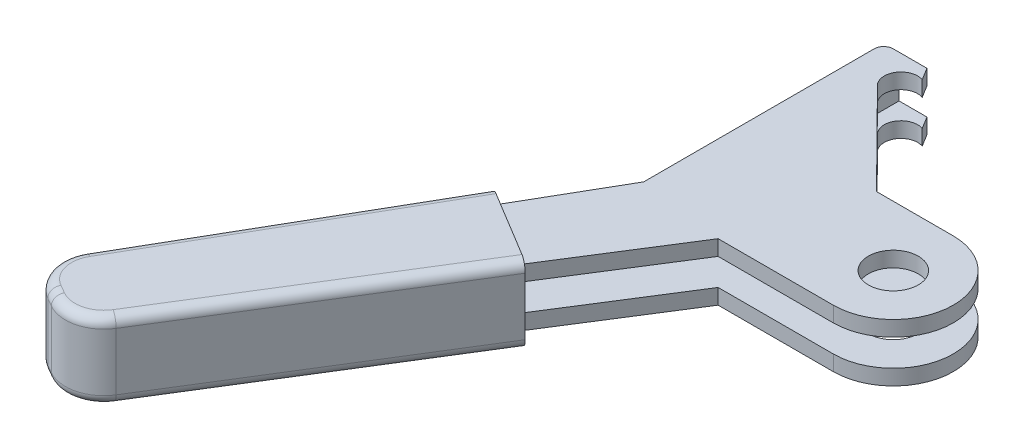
ISO-10303-21;
HEADER;
FILE_DESCRIPTION(('STEP AP214'),'2;1');
FILE_NAME('part.step','',(''),(''),'','','');
FILE_SCHEMA(('AUTOMOTIVE_DESIGN { 1 0 10303 214 1 1 1 1 }'));
ENDSEC;
DATA;
#1=APPLICATION_CONTEXT('core data for automotive mechanical design processes');
#2=APPLICATION_PROTOCOL_DEFINITION('international standard','automotive_design',2000,#1);
#3=PRODUCT_CONTEXT('',#1,'mechanical');
#4=PRODUCT('Part','Part','',(#3));
#5=PRODUCT_RELATED_PRODUCT_CATEGORY('part','',(#4));
#6=PRODUCT_DEFINITION_FORMATION('','',#4);
#7=PRODUCT_DEFINITION_CONTEXT('part definition',#1,'design');
#8=PRODUCT_DEFINITION('design','',#6,#7);
#9=PRODUCT_DEFINITION_SHAPE('','',#8);
#10=(LENGTH_UNIT() NAMED_UNIT(*) SI_UNIT(.MILLI.,.METRE.));
#11=(NAMED_UNIT(*) PLANE_ANGLE_UNIT() SI_UNIT($,.RADIAN.));
#12=(NAMED_UNIT(*) SI_UNIT($,.STERADIAN.) SOLID_ANGLE_UNIT());
#13=UNCERTAINTY_MEASURE_WITH_UNIT(LENGTH_MEASURE(1.E-05),#10,'distance_accuracy_value','');
#14=(GEOMETRIC_REPRESENTATION_CONTEXT(3) GLOBAL_UNCERTAINTY_ASSIGNED_CONTEXT((#13)) GLOBAL_UNIT_ASSIGNED_CONTEXT((#10,
#11,#12)) REPRESENTATION_CONTEXT('',''));
#15=CARTESIAN_POINT('',(0.,0.,0.));
#16=DIRECTION('',(0.,0.,1.));
#17=DIRECTION('',(1.,0.,0.));
#18=AXIS2_PLACEMENT_3D('',#15,#16,#17);
#19=CARTESIAN_POINT('',(-12.,3.,6.25));
#20=DIRECTION('',(-0.845429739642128,0.,-0.534086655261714));
#21=DIRECTION('',(0.,-1.,0.));
#22=AXIS2_PLACEMENT_3D('',#19,#20,#21);
#23=PLANE('',#22);
#24=DIRECTION('',(0.534086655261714,0.,-0.845429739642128));
#25=VECTOR('',#24,1.);
#26=CARTESIAN_POINT('',(-12.,3.,6.25));
#27=LINE('',#26,#25);
#28=CARTESIAN_POINT('',(-19.9323201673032,3.,18.8064256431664));
#29=VERTEX_POINT('',#28);
#30=CARTESIAN_POINT('',(-12.,3.,6.25));
#31=VERTEX_POINT('',#30);
#32=EDGE_CURVE('E370',#29,#31,#27,.T.);
#33=ORIENTED_EDGE('',*,*,#32,.F.);
#34=DIRECTION('',(0.,-1.,0.));
#35=VECTOR('',#34,1.);
#36=CARTESIAN_POINT('',(-19.9323201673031,3.,18.8064256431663));
#37=LINE('',#36,#35);
#38=CARTESIAN_POINT('',(-19.9323201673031,1.40000000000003,18.8064256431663));
#39=VERTEX_POINT('',#38);
#40=EDGE_CURVE('E318',#29,#39,#37,.T.);
#41=ORIENTED_EDGE('',*,*,#40,.T.);
#42=DIRECTION('',(0.534086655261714,0.,-0.845429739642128));
#43=VECTOR('',#42,1.);
#44=CARTESIAN_POINT('',(-12.,1.40000000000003,6.25));
#45=LINE('',#44,#43);
#46=CARTESIAN_POINT('',(-12.,1.40000000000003,6.25));
#47=VERTEX_POINT('',#46);
#48=EDGE_CURVE('E438',#39,#47,#45,.T.);
#49=ORIENTED_EDGE('',*,*,#48,.T.);
#50=DIRECTION('',(0.,-1.,0.));
#51=VECTOR('',#50,1.);
#52=CARTESIAN_POINT('',(-12.,3.,6.25));
#53=LINE('',#52,#51);
#54=EDGE_CURVE('E331',#31,#47,#53,.T.);
#55=ORIENTED_EDGE('',*,*,#54,.F.);
#56=EDGE_LOOP('',(#33,#41,#49,#55));
#57=FACE_BOUND('',#56,.T.);
#58=ADVANCED_FACE('F14',(#57),#23,.F.);
#59=CARTESIAN_POINT('',(-19.4,1.4,84.));
#60=DIRECTION('',(-1.,0.,0.));
#61=DIRECTION('',(0.,1.,0.));
#62=AXIS2_PLACEMENT_3D('',#59,#60,#61);
#63=PLANE('',#62);
#64=DIRECTION('',(0.,0.,-1.));
#65=VECTOR('',#64,1.);
#66=CARTESIAN_POINT('',(-19.4,1.4,84.));
#67=LINE('',#66,#65);
#68=CARTESIAN_POINT('',(-19.4,1.4,5.4287187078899));
#69=VERTEX_POINT('',#68);
#70=CARTESIAN_POINT('',(-19.4,1.4,-20.));
#71=VERTEX_POINT('',#70);
#72=EDGE_CURVE('E474',#69,#71,#67,.T.);
#73=ORIENTED_EDGE('',*,*,#72,.F.);
#74=DIRECTION('',(0.,-1.,0.));
#75=VECTOR('',#74,1.);
#76=CARTESIAN_POINT('',(-19.4,1.4,5.4287187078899));
#77=LINE('',#76,#75);
#78=CARTESIAN_POINT('',(-19.4,-1.4,5.4287187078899));
#79=VERTEX_POINT('',#78);
#80=EDGE_CURVE('E470',#69,#79,#77,.T.);
#81=ORIENTED_EDGE('',*,*,#80,.T.);
#82=DIRECTION('',(0.,0.,-1.));
#83=VECTOR('',#82,1.);
#84=CARTESIAN_POINT('',(-19.4,-1.4,84.));
#85=LINE('',#84,#83);
#86=CARTESIAN_POINT('',(-19.4,-1.4,-20.));
#87=VERTEX_POINT('',#86);
#88=EDGE_CURVE('E425',#79,#87,#85,.T.);
#89=ORIENTED_EDGE('',*,*,#88,.T.);
#90=DIRECTION('',(0.,1.,0.));
#91=VECTOR('',#90,1.);
#92=CARTESIAN_POINT('',(-19.4,1.4,-20.));
#93=LINE('',#92,#91);
#94=EDGE_CURVE('E417',#87,#71,#93,.T.);
#95=ORIENTED_EDGE('',*,*,#94,.T.);
#96=EDGE_LOOP('',(#73,#81,#89,#95));
#97=FACE_BOUND('',#96,.T.);
#98=ADVANCED_FACE('F933',(#97),#63,.F.);
#99=CARTESIAN_POINT('',(-16.5,3.,-20.));
#100=DIRECTION('',(-0.850594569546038,0.,0.525822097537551));
#101=DIRECTION('',(0.,-1.,0.));
#102=AXIS2_PLACEMENT_3D('',#99,#100,#101);
#103=PLANE('',#102);
#104=DIRECTION('',(0.,-1.,0.));
#105=VECTOR('',#104,1.);
#106=CARTESIAN_POINT('',(-15.7112668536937,3.,-18.724108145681));
#107=LINE('',#106,#105);
#108=CARTESIAN_POINT('',(-15.7112668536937,3.,-18.724108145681));
#109=VERTEX_POINT('',#108);
#110=CARTESIAN_POINT('',(-15.7112668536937,1.4,-18.724108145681));
#111=VERTEX_POINT('',#110);
#112=EDGE_CURVE('E348',#109,#111,#107,.T.);
#113=ORIENTED_EDGE('',*,*,#112,.T.);
#114=DIRECTION('',(-0.525822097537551,0.,-0.850594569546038));
#115=VECTOR('',#114,1.);
#116=CARTESIAN_POINT('',(-16.5,1.4,-20.));
#117=LINE('',#116,#115);
#118=CARTESIAN_POINT('',(-16.5,1.4,-20.));
#119=VERTEX_POINT('',#118);
#120=EDGE_CURVE('E359',#111,#119,#117,.T.);
#121=ORIENTED_EDGE('',*,*,#120,.T.);
#122=DIRECTION('',(0.,-1.,0.));
#123=VECTOR('',#122,1.);
#124=CARTESIAN_POINT('',(-16.5,3.,-20.));
#125=LINE('',#124,#123);
#126=CARTESIAN_POINT('',(-16.5,3.,-20.));
#127=VERTEX_POINT('',#126);
#128=EDGE_CURVE('E409',#127,#119,#125,.T.);
#129=ORIENTED_EDGE('',*,*,#128,.F.);
#130=DIRECTION('',(-0.525822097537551,0.,-0.850594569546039));
#131=VECTOR('',#130,1.);
#132=CARTESIAN_POINT('',(-16.5,3.,-20.));
#133=LINE('',#132,#131);
#134=EDGE_CURVE('E392',#109,#127,#133,.T.);
#135=ORIENTED_EDGE('',*,*,#134,.F.);
#136=EDGE_LOOP('',(#113,#121,#129,#135));
#137=FACE_BOUND('',#136,.T.);
#138=ADVANCED_FACE('F927',(#137),#103,.F.);
#139=CARTESIAN_POINT('',(-16.2889917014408,3.,-17.0868016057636));
#140=DIRECTION('',(0.,-1.,0.));
#141=DIRECTION('',(1.,0.,0.));
#142=AXIS2_PLACEMENT_3D('',#139,#140,#141);
#143=CYLINDRICAL_SURFACE('',#142,1.73624269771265);
#144=DIRECTION('',(0.,-1.,0.));
#145=VECTOR('',#144,1.);
#146=CARTESIAN_POINT('',(-17.430589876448,3.,-15.7786378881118));
#147=LINE('',#146,#145);
#148=CARTESIAN_POINT('',(-17.430589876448,3.,-15.7786378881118));
#149=VERTEX_POINT('',#148);
#150=CARTESIAN_POINT('',(-17.430589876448,1.4,-15.7786378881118));
#151=VERTEX_POINT('',#150);
#152=EDGE_CURVE('E456',#149,#151,#147,.T.);
#153=ORIENTED_EDGE('',*,*,#152,.T.);
#154=CARTESIAN_POINT('',(-16.2889917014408,1.4,-17.0868016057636));
#155=DIRECTION('',(0.,-1.,0.));
#156=DIRECTION('',(-1.,0.,0.));
#157=AXIS2_PLACEMENT_3D('',#154,#155,#156);
#158=CIRCLE('',#157,1.73624269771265);
#159=EDGE_CURVE('E459',#151,#111,#158,.T.);
#160=ORIENTED_EDGE('',*,*,#159,.T.);
#161=ORIENTED_EDGE('',*,*,#112,.F.);
#162=CARTESIAN_POINT('',(-16.2889917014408,3.,-17.0868016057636));
#163=DIRECTION('',(0.,-1.,0.));
#164=DIRECTION('',(-1.,0.,0.));
#165=AXIS2_PLACEMENT_3D('',#162,#163,#164);
#166=CIRCLE('',#165,1.73624269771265);
#167=EDGE_CURVE('E387',#149,#109,#166,.T.);
#168=ORIENTED_EDGE('',*,*,#167,.F.);
#169=EDGE_LOOP('',(#153,#160,#161,#168));
#170=FACE_BOUND('',#169,.T.);
#171=ADVANCED_FACE('F932',(#170),#143,.F.);
#172=CARTESIAN_POINT('',(-17.430589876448,3.,-15.7786378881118));
#173=DIRECTION('',(-0.710754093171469,0.,0.70344055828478));
#174=DIRECTION('',(0.,-1.,0.));
#175=AXIS2_PLACEMENT_3D('',#172,#173,#174);
#176=PLANE('',#175);
#177=DIRECTION('',(0.,-1.,0.));
#178=VECTOR('',#177,1.);
#179=CARTESIAN_POINT('',(-8.,3.,-6.25));
#180=LINE('',#179,#178);
#181=CARTESIAN_POINT('',(-8.,3.,-6.25));
#182=VERTEX_POINT('',#181);
#183=CARTESIAN_POINT('',(-8.,1.4,-6.25));
#184=VERTEX_POINT('',#183);
#185=EDGE_CURVE('E455',#182,#184,#180,.T.);
#186=ORIENTED_EDGE('',*,*,#185,.T.);
#187=DIRECTION('',(-0.70344055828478,0.,-0.710754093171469));
#188=VECTOR('',#187,1.);
#189=CARTESIAN_POINT('',(-17.430589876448,1.4,-15.7786378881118));
#190=LINE('',#189,#188);
#191=EDGE_CURVE('E451',#184,#151,#190,.T.);
#192=ORIENTED_EDGE('',*,*,#191,.T.);
#193=ORIENTED_EDGE('',*,*,#152,.F.);
#194=DIRECTION('',(-0.70344055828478,0.,-0.710754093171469));
#195=VECTOR('',#194,1.);
#196=CARTESIAN_POINT('',(-17.430589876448,3.,-15.7786378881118));
#197=LINE('',#196,#195);
#198=EDGE_CURVE('E391',#182,#149,#197,.T.);
#199=ORIENTED_EDGE('',*,*,#198,.F.);
#200=EDGE_LOOP('',(#186,#192,#193,#199));
#201=FACE_BOUND('',#200,.T.);
#202=ADVANCED_FACE('F943',(#201),#176,.F.);
#203=CARTESIAN_POINT('',(-8.,3.,-6.25));
#204=DIRECTION('',(0.,0.,1.));
#205=DIRECTION('',(-1.,0.,0.));
#206=AXIS2_PLACEMENT_3D('',#203,#204,#205);
#207=PLANE('',#206);
#208=DIRECTION('',(0.,-1.,0.));
#209=VECTOR('',#208,1.);
#210=CARTESIAN_POINT('',(0.,3.,-6.25));
#211=LINE('',#210,#209);
#212=CARTESIAN_POINT('',(0.,3.,-6.25));
#213=VERTEX_POINT('',#212);
#214=CARTESIAN_POINT('',(0.,1.39999999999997,-6.25));
#215=VERTEX_POINT('',#214);
#216=EDGE_CURVE('E447',#213,#215,#211,.T.);
#217=ORIENTED_EDGE('',*,*,#216,.T.);
#218=DIRECTION('',(-1.,0.,0.));
#219=VECTOR('',#218,1.);
#220=CARTESIAN_POINT('',(-8.,1.4,-6.25));
#221=LINE('',#220,#219);
#222=EDGE_CURVE('E450',#215,#184,#221,.T.);
#223=ORIENTED_EDGE('',*,*,#222,.T.);
#224=ORIENTED_EDGE('',*,*,#185,.F.);
#225=DIRECTION('',(-1.,0.,0.));
#226=VECTOR('',#225,1.);
#227=CARTESIAN_POINT('',(-8.,3.,-6.25));
#228=LINE('',#227,#226);
#229=EDGE_CURVE('E463',#213,#182,#228,.T.);
#230=ORIENTED_EDGE('',*,*,#229,.F.);
#231=EDGE_LOOP('',(#217,#223,#224,#230));
#232=FACE_BOUND('',#231,.T.);
#233=ADVANCED_FACE('F954',(#232),#207,.F.);
#234=CARTESIAN_POINT('',(0.,3.,0.));
#235=DIRECTION('',(0.,-1.,0.));
#236=DIRECTION('',(1.,0.,0.));
#237=AXIS2_PLACEMENT_3D('',#234,#235,#236);
#238=CYLINDRICAL_SURFACE('',#237,6.25);
#239=CARTESIAN_POINT('',(0.,3.,0.));
#240=DIRECTION('',(0.,1.,0.));
#241=DIRECTION('',(-1.,0.,0.));
#242=AXIS2_PLACEMENT_3D('',#239,#240,#241);
#243=CIRCLE('',#242,6.25);
#244=CARTESIAN_POINT('',(0.,3.,6.25));
#245=VERTEX_POINT('',#244);
#246=EDGE_CURVE('E371',#245,#213,#243,.T.);
#247=ORIENTED_EDGE('',*,*,#246,.F.);
#248=DIRECTION('',(0.,-1.,0.));
#249=VECTOR('',#248,1.);
#250=CARTESIAN_POINT('',(0.,3.,6.25));
#251=LINE('',#250,#249);
#252=CARTESIAN_POINT('',(0.,1.39999999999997,6.25));
#253=VERTEX_POINT('',#252);
#254=EDGE_CURVE('E443',#245,#253,#251,.T.);
#255=ORIENTED_EDGE('',*,*,#254,.T.);
#256=CARTESIAN_POINT('',(0.,1.39999999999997,0.));
#257=DIRECTION('',(0.,1.,0.));
#258=DIRECTION('',(-1.,0.,0.));
#259=AXIS2_PLACEMENT_3D('',#256,#257,#258);
#260=CIRCLE('',#259,6.25);
#261=EDGE_CURVE('E386',#253,#215,#260,.T.);
#262=ORIENTED_EDGE('',*,*,#261,.T.);
#263=ORIENTED_EDGE('',*,*,#216,.F.);
#264=EDGE_LOOP('',(#247,#255,#262,#263));
#265=FACE_BOUND('',#264,.T.);
#266=ADVANCED_FACE('F949',(#265),#238,.T.);
#267=CARTESIAN_POINT('',(0.,3.,6.25));
#268=DIRECTION('',(0.,0.,-1.));
#269=DIRECTION('',(0.,-1.,0.));
#270=AXIS2_PLACEMENT_3D('',#267,#268,#269);
#271=PLANE('',#270);
#272=ORIENTED_EDGE('',*,*,#54,.T.);
#273=DIRECTION('',(1.,0.,0.));
#274=VECTOR('',#273,1.);
#275=CARTESIAN_POINT('',(0.,1.39999999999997,6.25));
#276=LINE('',#275,#274);
#277=EDGE_CURVE('E338',#47,#253,#276,.T.);
#278=ORIENTED_EDGE('',*,*,#277,.T.);
#279=ORIENTED_EDGE('',*,*,#254,.F.);
#280=DIRECTION('',(1.,0.,0.));
#281=VECTOR('',#280,1.);
#282=CARTESIAN_POINT('',(0.,3.,6.25));
#283=LINE('',#282,#281);
#284=EDGE_CURVE('E366',#31,#245,#283,.T.);
#285=ORIENTED_EDGE('',*,*,#284,.F.);
#286=EDGE_LOOP('',(#272,#278,#279,#285));
#287=FACE_BOUND('',#286,.T.);
#288=ADVANCED_FACE('F788',(#287),#271,.F.);
#289=CARTESIAN_POINT('',(0.,3.,0.));
#290=DIRECTION('',(0.,-1.,0.));
#291=DIRECTION('',(1.,0.,0.));
#292=AXIS2_PLACEMENT_3D('',#289,#290,#291);
#293=CYLINDRICAL_SURFACE('',#292,2.6);
#294=CARTESIAN_POINT('',(0.,1.39999999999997,0.));
#295=DIRECTION('',(0.,1.,0.));
#296=DIRECTION('',(-1.,0.,0.));
#297=AXIS2_PLACEMENT_3D('',#294,#295,#296);
#298=CIRCLE('',#297,2.6);
#299=CARTESIAN_POINT('',(-2.59999999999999,1.39999999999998,0.));
#300=VERTEX_POINT('',#299);
#301=EDGE_CURVE('E350',#300,#300,#298,.T.);
#302=ORIENTED_EDGE('',*,*,#301,.F.);
#303=EDGE_LOOP('',(#302));
#304=FACE_BOUND('',#303,.T.);
#305=CARTESIAN_POINT('',(0.,3.,0.));
#306=DIRECTION('',(0.,1.,0.));
#307=DIRECTION('',(-1.,0.,0.));
#308=AXIS2_PLACEMENT_3D('',#305,#306,#307);
#309=CIRCLE('',#308,2.6);
#310=CARTESIAN_POINT('',(-2.59999999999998,3.,0.));
#311=VERTEX_POINT('',#310);
#312=EDGE_CURVE('E382',#311,#311,#309,.T.);
#313=ORIENTED_EDGE('',*,*,#312,.T.);
#314=EDGE_LOOP('',(#313));
#315=FACE_BOUND('',#314,.T.);
#316=ADVANCED_FACE('F900',(#304,#315),#293,.F.);
#317=CARTESIAN_POINT('',(0.,3.,0.));
#318=DIRECTION('',(0.,-1.,0.));
#319=DIRECTION('',(1.,0.,0.));
#320=AXIS2_PLACEMENT_3D('',#317,#318,#319);
#321=CYLINDRICAL_SURFACE('',#320,6.25);
#322=CARTESIAN_POINT('',(0.,-1.40000000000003,0.));
#323=DIRECTION('',(0.,-1.,0.));
#324=DIRECTION('',(1.,0.,0.));
#325=AXIS2_PLACEMENT_3D('',#322,#323,#324);
#326=CIRCLE('',#325,6.25);
#327=CARTESIAN_POINT('',(0.,-1.40000000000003,-6.25));
#328=VERTEX_POINT('',#327);
#329=CARTESIAN_POINT('',(0.,-1.40000000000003,6.25));
#330=VERTEX_POINT('',#329);
#331=EDGE_CURVE('E396',#328,#330,#326,.T.);
#332=ORIENTED_EDGE('',*,*,#331,.T.);
#333=DIRECTION('',(0.,-1.,0.));
#334=VECTOR('',#333,1.);
#335=CARTESIAN_POINT('',(0.,3.,6.25));
#336=LINE('',#335,#334);
#337=CARTESIAN_POINT('',(0.,-3.,6.25));
#338=VERTEX_POINT('',#337);
#339=EDGE_CURVE('E429',#330,#338,#336,.T.);
#340=ORIENTED_EDGE('',*,*,#339,.T.);
#341=CARTESIAN_POINT('',(0.,-3.,0.));
#342=DIRECTION('',(0.,1.,0.));
#343=DIRECTION('',(-1.,0.,0.));
#344=AXIS2_PLACEMENT_3D('',#341,#342,#343);
#345=CIRCLE('',#344,6.25);
#346=CARTESIAN_POINT('',(0.,-3.,-6.25));
#347=VERTEX_POINT('',#346);
#348=EDGE_CURVE('E408',#338,#347,#345,.T.);
#349=ORIENTED_EDGE('',*,*,#348,.T.);
#350=DIRECTION('',(0.,-1.,0.));
#351=VECTOR('',#350,1.);
#352=CARTESIAN_POINT('',(0.,3.,-6.25));
#353=LINE('',#352,#351);
#354=EDGE_CURVE('E361',#328,#347,#353,.T.);
#355=ORIENTED_EDGE('',*,*,#354,.F.);
#356=EDGE_LOOP('',(#332,#340,#349,#355));
#357=FACE_BOUND('',#356,.T.);
#358=ADVANCED_FACE('F825',(#357),#321,.T.);
#359=CARTESIAN_POINT('',(-8.,3.,-6.25));
#360=DIRECTION('',(0.,0.,1.));
#361=DIRECTION('',(-1.,0.,0.));
#362=AXIS2_PLACEMENT_3D('',#359,#360,#361);
#363=PLANE('',#362);
#364=DIRECTION('',(0.,-1.,0.));
#365=VECTOR('',#364,1.);
#366=CARTESIAN_POINT('',(-8.,3.,-6.25));
#367=LINE('',#366,#365);
#368=CARTESIAN_POINT('',(-8.,-1.4,-6.25));
#369=VERTEX_POINT('',#368);
#370=CARTESIAN_POINT('',(-8.,-3.,-6.25));
#371=VERTEX_POINT('',#370);
#372=EDGE_CURVE('E380',#369,#371,#367,.T.);
#373=ORIENTED_EDGE('',*,*,#372,.F.);
#374=DIRECTION('',(1.,0.,0.));
#375=VECTOR('',#374,1.);
#376=CARTESIAN_POINT('',(-8.,-1.4,-6.25));
#377=LINE('',#376,#375);
#378=EDGE_CURVE('E364',#369,#328,#377,.T.);
#379=ORIENTED_EDGE('',*,*,#378,.T.);
#380=ORIENTED_EDGE('',*,*,#354,.T.);
#381=DIRECTION('',(-1.,0.,0.));
#382=VECTOR('',#381,1.);
#383=CARTESIAN_POINT('',(-8.,-3.,-6.25));
#384=LINE('',#383,#382);
#385=EDGE_CURVE('E365',#347,#371,#384,.T.);
#386=ORIENTED_EDGE('',*,*,#385,.T.);
#387=EDGE_LOOP('',(#373,#379,#380,#386));
#388=FACE_BOUND('',#387,.T.);
#389=ADVANCED_FACE('F822',(#388),#363,.F.);
#390=CARTESIAN_POINT('',(-17.430589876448,3.,-15.7786378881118));
#391=DIRECTION('',(-0.710754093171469,0.,0.70344055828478));
#392=DIRECTION('',(0.,-1.,0.));
#393=AXIS2_PLACEMENT_3D('',#390,#391,#392);
#394=PLANE('',#393);
#395=DIRECTION('',(0.,-1.,0.));
#396=VECTOR('',#395,1.);
#397=CARTESIAN_POINT('',(-17.430589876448,3.,-15.7786378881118));
#398=LINE('',#397,#396);
#399=CARTESIAN_POINT('',(-17.430589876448,-1.4,-15.7786378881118));
#400=VERTEX_POINT('',#399);
#401=CARTESIAN_POINT('',(-17.430589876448,-3.,-15.7786378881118));
#402=VERTEX_POINT('',#401);
#403=EDGE_CURVE('E439',#400,#402,#398,.T.);
#404=ORIENTED_EDGE('',*,*,#403,.F.);
#405=DIRECTION('',(0.70344055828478,0.,0.710754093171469));
#406=VECTOR('',#405,1.);
#407=CARTESIAN_POINT('',(-17.430589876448,-1.4,-15.7786378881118));
#408=LINE('',#407,#406);
#409=EDGE_CURVE('E375',#400,#369,#408,.T.);
#410=ORIENTED_EDGE('',*,*,#409,.T.);
#411=ORIENTED_EDGE('',*,*,#372,.T.);
#412=DIRECTION('',(-0.70344055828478,0.,-0.710754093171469));
#413=VECTOR('',#412,1.);
#414=CARTESIAN_POINT('',(-17.430589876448,-3.,-15.7786378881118));
#415=LINE('',#414,#413);
#416=EDGE_CURVE('E376',#371,#402,#415,.T.);
#417=ORIENTED_EDGE('',*,*,#416,.T.);
#418=EDGE_LOOP('',(#404,#410,#411,#417));
#419=FACE_BOUND('',#418,.T.);
#420=ADVANCED_FACE('F818',(#419),#394,.F.);
#421=CARTESIAN_POINT('',(-16.2889917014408,3.,-17.0868016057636));
#422=DIRECTION('',(0.,-1.,0.));
#423=DIRECTION('',(1.,0.,0.));
#424=AXIS2_PLACEMENT_3D('',#421,#422,#423);
#425=CYLINDRICAL_SURFACE('',#424,1.73624269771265);
#426=DIRECTION('',(0.,-1.,0.));
#427=VECTOR('',#426,1.);
#428=CARTESIAN_POINT('',(-15.7112668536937,3.,-18.724108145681));
#429=LINE('',#428,#427);
#430=CARTESIAN_POINT('',(-15.7112668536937,-1.4,-18.724108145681));
#431=VERTEX_POINT('',#430);
#432=CARTESIAN_POINT('',(-15.7112668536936,-3.,-18.724108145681));
#433=VERTEX_POINT('',#432);
#434=EDGE_CURVE('E516',#431,#433,#429,.T.);
#435=ORIENTED_EDGE('',*,*,#434,.F.);
#436=CARTESIAN_POINT('',(-16.2889917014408,-1.4,-17.0868016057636));
#437=DIRECTION('',(0.,1.,0.));
#438=DIRECTION('',(1.,0.,0.));
#439=AXIS2_PLACEMENT_3D('',#436,#437,#438);
#440=CIRCLE('',#439,1.73624269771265);
#441=EDGE_CURVE('E381',#431,#400,#440,.T.);
#442=ORIENTED_EDGE('',*,*,#441,.T.);
#443=ORIENTED_EDGE('',*,*,#403,.T.);
#444=CARTESIAN_POINT('',(-16.2889917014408,-3.,-17.0868016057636));
#445=DIRECTION('',(0.,-1.,0.));
#446=DIRECTION('',(-1.,0.,0.));
#447=AXIS2_PLACEMENT_3D('',#444,#445,#446);
#448=CIRCLE('',#447,1.73624269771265);
#449=EDGE_CURVE('E442',#402,#433,#448,.T.);
#450=ORIENTED_EDGE('',*,*,#449,.T.);
#451=EDGE_LOOP('',(#435,#442,#443,#450));
#452=FACE_BOUND('',#451,.T.);
#453=ADVANCED_FACE('F814',(#452),#425,.F.);
#454=CARTESIAN_POINT('',(-16.5,3.,-20.));
#455=DIRECTION('',(-0.850594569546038,0.,0.525822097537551));
#456=DIRECTION('',(0.,-1.,0.));
#457=AXIS2_PLACEMENT_3D('',#454,#455,#456);
#458=PLANE('',#457);
#459=DIRECTION('',(0.,-1.,0.));
#460=VECTOR('',#459,1.);
#461=CARTESIAN_POINT('',(-16.5,3.,-20.));
#462=LINE('',#461,#460);
#463=CARTESIAN_POINT('',(-16.5,-1.4,-20.));
#464=VERTEX_POINT('',#463);
#465=CARTESIAN_POINT('',(-16.5,-3.,-20.));
#466=VERTEX_POINT('',#465);
#467=EDGE_CURVE('E356',#464,#466,#462,.T.);
#468=ORIENTED_EDGE('',*,*,#467,.F.);
#469=DIRECTION('',(0.525822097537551,0.,0.850594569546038));
#470=VECTOR('',#469,1.);
#471=CARTESIAN_POINT('',(-16.5,-1.4,-20.));
#472=LINE('',#471,#470);
#473=EDGE_CURVE('E520',#464,#431,#472,.T.);
#474=ORIENTED_EDGE('',*,*,#473,.T.);
#475=ORIENTED_EDGE('',*,*,#434,.T.);
#476=DIRECTION('',(-0.525822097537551,0.,-0.850594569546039));
#477=VECTOR('',#476,1.);
#478=CARTESIAN_POINT('',(-16.5,-3.,-20.));
#479=LINE('',#478,#477);
#480=EDGE_CURVE('E521',#433,#466,#479,.T.);
#481=ORIENTED_EDGE('',*,*,#480,.T.);
#482=EDGE_LOOP('',(#468,#474,#475,#481));
#483=FACE_BOUND('',#482,.T.);
#484=ADVANCED_FACE('F811',(#483),#458,.F.);
#485=CARTESIAN_POINT('',(-16.5,3.,-20.));
#486=DIRECTION('',(0.,0.,1.));
#487=DIRECTION('',(-1.,0.,0.));
#488=AXIS2_PLACEMENT_3D('',#485,#486,#487);
#489=PLANE('',#488);
#490=ORIENTED_EDGE('',*,*,#94,.F.);
#491=DIRECTION('',(-1.,0.,0.));
#492=VECTOR('',#491,1.);
#493=CARTESIAN_POINT('',(-19.4,-1.4,-20.));
#494=LINE('',#493,#492);
#495=EDGE_CURVE('E414',#464,#87,#494,.T.);
#496=ORIENTED_EDGE('',*,*,#495,.F.);
#497=ORIENTED_EDGE('',*,*,#467,.T.);
#498=DIRECTION('',(-1.,0.,0.));
#499=VECTOR('',#498,1.);
#500=CARTESIAN_POINT('',(-16.5,-3.,-20.));
#501=LINE('',#500,#499);
#502=CARTESIAN_POINT('',(-20.,-3.,-20.));
#503=VERTEX_POINT('',#502);
#504=EDGE_CURVE('E360',#466,#503,#501,.T.);
#505=ORIENTED_EDGE('',*,*,#504,.T.);
#506=DIRECTION('',(0.,1.,0.));
#507=VECTOR('',#506,1.);
#508=CARTESIAN_POINT('',(-20.,3.,-20.));
#509=LINE('',#508,#507);
#510=CARTESIAN_POINT('',(-20.,3.,-20.));
#511=VERTEX_POINT('',#510);
#512=EDGE_CURVE('E412',#503,#511,#509,.T.);
#513=ORIENTED_EDGE('',*,*,#512,.T.);
#514=DIRECTION('',(-1.,0.,0.));
#515=VECTOR('',#514,1.);
#516=CARTESIAN_POINT('',(-16.5,3.,-20.));
#517=LINE('',#516,#515);
#518=EDGE_CURVE('E430',#127,#511,#517,.T.);
#519=ORIENTED_EDGE('',*,*,#518,.F.);
#520=ORIENTED_EDGE('',*,*,#128,.T.);
#521=DIRECTION('',(1.,0.,0.));
#522=VECTOR('',#521,1.);
#523=CARTESIAN_POINT('',(-19.4,1.4,-20.));
#524=LINE('',#523,#522);
#525=EDGE_CURVE('E354',#71,#119,#524,.T.);
#526=ORIENTED_EDGE('',*,*,#525,.F.);
#527=EDGE_LOOP('',(#490,#496,#497,#505,#513,#519,#520,#526));
#528=FACE_BOUND('',#527,.T.);
#529=ADVANCED_FACE('F807',(#528),#489,.F.);
#530=CARTESIAN_POINT('',(-20.,3.,-19.));
#531=DIRECTION('',(0.,-1.,0.));
#532=DIRECTION('',(1.,0.,0.));
#533=AXIS2_PLACEMENT_3D('',#530,#531,#532);
#534=CYLINDRICAL_SURFACE('',#533,1.);
#535=CARTESIAN_POINT('',(-20.,3.,-19.));
#536=DIRECTION('',(0.,1.,0.));
#537=DIRECTION('',(-1.,0.,0.));
#538=AXIS2_PLACEMENT_3D('',#535,#536,#537);
#539=CIRCLE('',#538,1.);
#540=CARTESIAN_POINT('',(-21.,3.,-19.));
#541=VERTEX_POINT('',#540);
#542=EDGE_CURVE('E434',#511,#541,#539,.T.);
#543=ORIENTED_EDGE('',*,*,#542,.F.);
#544=ORIENTED_EDGE('',*,*,#512,.F.);
#545=CARTESIAN_POINT('',(-20.,-3.,-19.));
#546=DIRECTION('',(0.,-1.,0.));
#547=DIRECTION('',(-1.,0.,0.));
#548=AXIS2_PLACEMENT_3D('',#545,#546,#547);
#549=CIRCLE('',#548,1.);
#550=CARTESIAN_POINT('',(-21.,-3.,-19.));
#551=VERTEX_POINT('',#550);
#552=EDGE_CURVE('E347',#551,#503,#549,.T.);
#553=ORIENTED_EDGE('',*,*,#552,.F.);
#554=DIRECTION('',(0.,-1.,0.));
#555=VECTOR('',#554,1.);
#556=CARTESIAN_POINT('',(-21.,3.,-19.));
#557=LINE('',#556,#555);
#558=EDGE_CURVE('E413',#541,#551,#557,.T.);
#559=ORIENTED_EDGE('',*,*,#558,.F.);
#560=EDGE_LOOP('',(#543,#544,#553,#559));
#561=FACE_BOUND('',#560,.T.);
#562=ADVANCED_FACE('F801',(#561),#534,.T.);
#563=CARTESIAN_POINT('',(0.,3.,0.));
#564=DIRECTION('',(0.,-1.,0.));
#565=DIRECTION('',(1.,0.,0.));
#566=AXIS2_PLACEMENT_3D('',#563,#564,#565);
#567=CYLINDRICAL_SURFACE('',#566,2.6);
#568=CARTESIAN_POINT('',(0.,-3.,0.));
#569=DIRECTION('',(0.,1.,0.));
#570=DIRECTION('',(-1.,0.,0.));
#571=AXIS2_PLACEMENT_3D('',#568,#569,#570);
#572=CIRCLE('',#571,2.6);
#573=CARTESIAN_POINT('',(-2.6,-3.,0.));
#574=VERTEX_POINT('',#573);
#575=EDGE_CURVE('E344',#574,#574,#572,.T.);
#576=ORIENTED_EDGE('',*,*,#575,.F.);
#577=EDGE_LOOP('',(#576));
#578=FACE_BOUND('',#577,.T.);
#579=CARTESIAN_POINT('',(0.,-1.40000000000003,0.));
#580=DIRECTION('',(0.,-1.,0.));
#581=DIRECTION('',(1.,0.,0.));
#582=AXIS2_PLACEMENT_3D('',#579,#580,#581);
#583=CIRCLE('',#582,2.6);
#584=CARTESIAN_POINT('',(2.60000000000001,-1.40000000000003,0.));
#585=VERTEX_POINT('',#584);
#586=EDGE_CURVE('E498',#585,#585,#583,.T.);
#587=ORIENTED_EDGE('',*,*,#586,.F.);
#588=EDGE_LOOP('',(#587));
#589=FACE_BOUND('',#588,.T.);
#590=ADVANCED_FACE('F971',(#578,#589),#567,.F.);
#591=CARTESIAN_POINT('',(-3.98668228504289,1.4,-21.2679306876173));
#592=DIRECTION('',(-0.866025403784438,0.,-0.5));
#593=DIRECTION('',(0.,-1.,0.));
#594=AXIS2_PLACEMENT_3D('',#591,#592,#593);
#595=PLANE('',#594);
#596=DIRECTION('',(-0.5,0.,0.866025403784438));
#597=VECTOR('',#596,1.);
#598=CARTESIAN_POINT('',(-3.98668228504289,1.4,-21.2679306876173));
#599=LINE('',#598,#597);
#600=CARTESIAN_POINT('',(-25.2629285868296,1.4,15.5836089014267));
#601=VERTEX_POINT('',#600);
#602=EDGE_CURVE('E355',#69,#601,#599,.T.);
#603=ORIENTED_EDGE('',*,*,#602,.T.);
#604=DIRECTION('',(0.,1.,0.));
#605=VECTOR('',#604,1.);
#606=CARTESIAN_POINT('',(-25.2629285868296,-40.5386580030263,15.5836089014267));
#607=LINE('',#606,#605);
#608=CARTESIAN_POINT('',(-25.2629285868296,-1.4,15.5836089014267));
#609=VERTEX_POINT('',#608);
#610=EDGE_CURVE('E38',#609,#601,#607,.T.);
#611=ORIENTED_EDGE('',*,*,#610,.F.);
#612=DIRECTION('',(-0.5,0.,0.866025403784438));
#613=VECTOR('',#612,1.);
#614=CARTESIAN_POINT('',(-3.98668228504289,-1.4,-21.2679306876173));
#615=LINE('',#614,#613);
#616=EDGE_CURVE('E418',#79,#609,#615,.T.);
#617=ORIENTED_EDGE('',*,*,#616,.F.);
#618=ORIENTED_EDGE('',*,*,#80,.F.);
#619=EDGE_LOOP('',(#603,#611,#617,#618));
#620=FACE_BOUND('',#619,.T.);
#621=ADVANCED_FACE('F778',(#620),#595,.F.);
#622=CARTESIAN_POINT('',(0.,3.,6.25));
#623=DIRECTION('',(0.,0.,-1.));
#624=DIRECTION('',(0.,-1.,0.));
#625=AXIS2_PLACEMENT_3D('',#622,#623,#624);
#626=PLANE('',#625);
#627=ORIENTED_EDGE('',*,*,#339,.F.);
#628=DIRECTION('',(-1.,0.,0.));
#629=VECTOR('',#628,1.);
#630=CARTESIAN_POINT('',(0.,-1.40000000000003,6.25));
#631=LINE('',#630,#629);
#632=CARTESIAN_POINT('',(-12.,-1.40000000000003,6.25));
#633=VERTEX_POINT('',#632);
#634=EDGE_CURVE('E738',#330,#633,#631,.T.);
#635=ORIENTED_EDGE('',*,*,#634,.T.);
#636=DIRECTION('',(0.,-1.,0.));
#637=VECTOR('',#636,1.);
#638=CARTESIAN_POINT('',(-12.,3.,6.25));
#639=LINE('',#638,#637);
#640=CARTESIAN_POINT('',(-12.,-3.,6.25));
#641=VERTEX_POINT('',#640);
#642=EDGE_CURVE('E342',#633,#641,#639,.T.);
#643=ORIENTED_EDGE('',*,*,#642,.T.);
#644=DIRECTION('',(1.,0.,0.));
#645=VECTOR('',#644,1.);
#646=CARTESIAN_POINT('',(0.,-3.,6.25));
#647=LINE('',#646,#645);
#648=EDGE_CURVE('E329',#641,#338,#647,.T.);
#649=ORIENTED_EDGE('',*,*,#648,.T.);
#650=EDGE_LOOP('',(#627,#635,#643,#649));
#651=FACE_BOUND('',#650,.T.);
#652=ADVANCED_FACE('F829',(#651),#626,.F.);
#653=CARTESIAN_POINT('',(-16.2889917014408,-3.,-17.0868016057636));
#654=DIRECTION('',(0.,1.,0.));
#655=DIRECTION('',(-1.,0.,0.));
#656=AXIS2_PLACEMENT_3D('',#653,#654,#655);
#657=PLANE('',#656);
#658=ORIENTED_EDGE('',*,*,#575,.T.);
#659=EDGE_LOOP('',(#658));
#660=FACE_BOUND('',#659,.T.);
#661=DIRECTION('',(0.855756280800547,0.,0.517379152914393));
#662=VECTOR('',#661,1.);
#663=CARTESIAN_POINT('',(-33.1559850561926,-3.,10.8115692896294));
#664=LINE('',#663,#662);
#665=CARTESIAN_POINT('',(-26.6324176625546,-3.,14.7556335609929));
#666=VERTEX_POINT('',#665);
#667=CARTESIAN_POINT('',(-19.932320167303,-3.,18.8064256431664));
#668=VERTEX_POINT('',#667);
#669=EDGE_CURVE('E23',#666,#668,#664,.T.);
#670=ORIENTED_EDGE('',*,*,#669,.F.);
#671=DIRECTION('',(-0.5,0.,0.866025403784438));
#672=VECTOR('',#671,1.);
#673=CARTESIAN_POINT('',(-21.,-3.,5.));
#674=LINE('',#673,#672);
#675=CARTESIAN_POINT('',(-21.,-3.,5.));
#676=VERTEX_POINT('',#675);
#677=EDGE_CURVE('E402',#676,#666,#674,.T.);
#678=ORIENTED_EDGE('',*,*,#677,.F.);
#679=DIRECTION('',(0.,0.,1.));
#680=VECTOR('',#679,1.);
#681=CARTESIAN_POINT('',(-21.,-3.,-20.));
#682=LINE('',#681,#680);
#683=EDGE_CURVE('E405',#551,#676,#682,.T.);
#684=ORIENTED_EDGE('',*,*,#683,.F.);
#685=ORIENTED_EDGE('',*,*,#552,.T.);
#686=ORIENTED_EDGE('',*,*,#504,.F.);
#687=ORIENTED_EDGE('',*,*,#480,.F.);
#688=ORIENTED_EDGE('',*,*,#449,.F.);
#689=ORIENTED_EDGE('',*,*,#416,.F.);
#690=ORIENTED_EDGE('',*,*,#385,.F.);
#691=ORIENTED_EDGE('',*,*,#348,.F.);
#692=ORIENTED_EDGE('',*,*,#648,.F.);
#693=DIRECTION('',(0.534086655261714,0.,-0.845429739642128));
#694=VECTOR('',#693,1.);
#695=CARTESIAN_POINT('',(-12.,-3.,6.25));
#696=LINE('',#695,#694);
#697=EDGE_CURVE('E311',#668,#641,#696,.T.);
#698=ORIENTED_EDGE('',*,*,#697,.F.);
#699=EDGE_LOOP('',(#670,#678,#684,#685,#686,#687,#688,#689,#690,#691,#692,#698));
#700=FACE_BOUND('',#699,.T.);
#701=ADVANCED_FACE('F327',(#660,#700),#657,.F.);
#702=DIRECTION('',(-0.534086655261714,0.,0.845429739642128));
#703=VECTOR('',#702,1.);
#704=CARTESIAN_POINT('',(-12.,-1.40000000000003,6.25));
#705=LINE('',#704,#703);
#706=CARTESIAN_POINT('',(-19.9323201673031,-1.4,18.8064256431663));
#707=VERTEX_POINT('',#706);
#708=EDGE_CURVE('E314',#633,#707,#705,.T.);
#709=ORIENTED_EDGE('',*,*,#708,.T.);
#710=EDGE_CURVE('E307',#707,#668,#37,.T.);
#711=ORIENTED_EDGE('',*,*,#710,.T.);
#712=ORIENTED_EDGE('',*,*,#697,.T.);
#713=ORIENTED_EDGE('',*,*,#642,.F.);
#714=EDGE_LOOP('',(#709,#711,#712,#713));
#715=FACE_BOUND('',#714,.T.);
#716=ADVANCED_FACE('F309',(#715),#23,.F.);
#717=CARTESIAN_POINT('',(-19.4,1.4,84.));
#718=DIRECTION('',(0.,1.,0.));
#719=DIRECTION('',(-1.,0.,0.));
#720=AXIS2_PLACEMENT_3D('',#717,#718,#719);
#721=PLANE('',#720);
#722=ORIENTED_EDGE('',*,*,#48,.F.);
#723=DIRECTION('',(-0.855756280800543,0.,-0.517379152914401));
#724=VECTOR('',#723,1.);
#725=CARTESIAN_POINT('',(9.32199291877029,1.4,36.4932040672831));
#726=LINE('',#725,#724);
#727=EDGE_CURVE('E31',#39,#601,#726,.T.);
#728=ORIENTED_EDGE('',*,*,#727,.T.);
#729=ORIENTED_EDGE('',*,*,#602,.F.);
#730=ORIENTED_EDGE('',*,*,#72,.T.);
#731=ORIENTED_EDGE('',*,*,#525,.T.);
#732=ORIENTED_EDGE('',*,*,#120,.F.);
#733=ORIENTED_EDGE('',*,*,#159,.F.);
#734=ORIENTED_EDGE('',*,*,#191,.F.);
#735=ORIENTED_EDGE('',*,*,#222,.F.);
#736=ORIENTED_EDGE('',*,*,#261,.F.);
#737=ORIENTED_EDGE('',*,*,#277,.F.);
#738=EDGE_LOOP('',(#722,#728,#729,#730,#731,#732,#733,#734,#735,#736,#737));
#739=FACE_BOUND('',#738,.T.);
#740=ORIENTED_EDGE('',*,*,#301,.T.);
#741=EDGE_LOOP('',(#740));
#742=FACE_BOUND('',#741,.T.);
#743=ADVANCED_FACE('F783',(#739,#742),#721,.F.);
#744=CARTESIAN_POINT('',(-19.4,-1.4,84.));
#745=DIRECTION('',(0.,-1.,0.));
#746=DIRECTION('',(0.,0.,-1.));
#747=AXIS2_PLACEMENT_3D('',#744,#745,#746);
#748=PLANE('',#747);
#749=ORIENTED_EDGE('',*,*,#616,.T.);
#750=DIRECTION('',(0.855756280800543,0.,0.517379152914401));
#751=VECTOR('',#750,1.);
#752=CARTESIAN_POINT('',(9.32199291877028,-1.4,36.4932040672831));
#753=LINE('',#752,#751);
#754=EDGE_CURVE('E728',#609,#707,#753,.T.);
#755=ORIENTED_EDGE('',*,*,#754,.T.);
#756=ORIENTED_EDGE('',*,*,#708,.F.);
#757=ORIENTED_EDGE('',*,*,#634,.F.);
#758=ORIENTED_EDGE('',*,*,#331,.F.);
#759=ORIENTED_EDGE('',*,*,#378,.F.);
#760=ORIENTED_EDGE('',*,*,#409,.F.);
#761=ORIENTED_EDGE('',*,*,#441,.F.);
#762=ORIENTED_EDGE('',*,*,#473,.F.);
#763=ORIENTED_EDGE('',*,*,#495,.T.);
#764=ORIENTED_EDGE('',*,*,#88,.F.);
#765=EDGE_LOOP('',(#749,#755,#756,#757,#758,#759,#760,#761,#762,#763,#764));
#766=FACE_BOUND('',#765,.T.);
#767=ORIENTED_EDGE('',*,*,#586,.T.);
#768=EDGE_LOOP('',(#767));
#769=FACE_BOUND('',#768,.T.);
#770=ADVANCED_FACE('F894',(#766,#769),#748,.F.);
#771=CARTESIAN_POINT('',(-21.,3.,-20.));
#772=DIRECTION('',(1.,0.,0.));
#773=DIRECTION('',(0.,1.,0.));
#774=AXIS2_PLACEMENT_3D('',#771,#772,#773);
#775=PLANE('',#774);
#776=DIRECTION('',(0.,0.,1.));
#777=VECTOR('',#776,1.);
#778=CARTESIAN_POINT('',(-21.,3.,-20.));
#779=LINE('',#778,#777);
#780=CARTESIAN_POINT('',(-21.,3.,5.));
#781=VERTEX_POINT('',#780);
#782=EDGE_CURVE('E401',#541,#781,#779,.T.);
#783=ORIENTED_EDGE('',*,*,#782,.F.);
#784=ORIENTED_EDGE('',*,*,#558,.T.);
#785=ORIENTED_EDGE('',*,*,#683,.T.);
#786=DIRECTION('',(0.,-1.,0.));
#787=VECTOR('',#786,1.);
#788=CARTESIAN_POINT('',(-21.,3.,5.));
#789=LINE('',#788,#787);
#790=EDGE_CURVE('E334',#781,#676,#789,.T.);
#791=ORIENTED_EDGE('',*,*,#790,.F.);
#792=EDGE_LOOP('',(#783,#784,#785,#791));
#793=FACE_BOUND('',#792,.T.);
#794=ADVANCED_FACE('F798',(#793),#775,.F.);
#795=CARTESIAN_POINT('',(-16.2889917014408,3.,-17.0868016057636));
#796=DIRECTION('',(0.,1.,0.));
#797=DIRECTION('',(-1.,0.,0.));
#798=AXIS2_PLACEMENT_3D('',#795,#796,#797);
#799=PLANE('',#798);
#800=ORIENTED_EDGE('',*,*,#312,.F.);
#801=EDGE_LOOP('',(#800));
#802=FACE_BOUND('',#801,.T.);
#803=DIRECTION('',(-0.5,0.,0.866025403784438));
#804=VECTOR('',#803,1.);
#805=CARTESIAN_POINT('',(-21.,3.,5.));
#806=LINE('',#805,#804);
#807=CARTESIAN_POINT('',(-26.6324176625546,3.,14.7556335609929));
#808=VERTEX_POINT('',#807);
#809=EDGE_CURVE('E397',#781,#808,#806,.T.);
#810=ORIENTED_EDGE('',*,*,#809,.T.);
#811=DIRECTION('',(0.855756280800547,0.,0.517379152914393));
#812=VECTOR('',#811,1.);
#813=CARTESIAN_POINT('',(-33.1559850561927,3.,10.8115692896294));
#814=LINE('',#813,#812);
#815=EDGE_CURVE('E9',#808,#29,#814,.T.);
#816=ORIENTED_EDGE('',*,*,#815,.T.);
#817=ORIENTED_EDGE('',*,*,#32,.T.);
#818=ORIENTED_EDGE('',*,*,#284,.T.);
#819=ORIENTED_EDGE('',*,*,#246,.T.);
#820=ORIENTED_EDGE('',*,*,#229,.T.);
#821=ORIENTED_EDGE('',*,*,#198,.T.);
#822=ORIENTED_EDGE('',*,*,#167,.T.);
#823=ORIENTED_EDGE('',*,*,#134,.T.);
#824=ORIENTED_EDGE('',*,*,#518,.T.);
#825=ORIENTED_EDGE('',*,*,#542,.T.);
#826=ORIENTED_EDGE('',*,*,#782,.T.);
#827=EDGE_LOOP('',(#810,#816,#817,#818,#819,#820,#821,#822,#823,#824,#825,#826));
#828=FACE_BOUND('',#827,.T.);
#829=ADVANCED_FACE('F791',(#802,#828),#799,.T.);
#830=CARTESIAN_POINT('',(-21.,3.,5.));
#831=DIRECTION('',(0.866025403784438,0.,0.5));
#832=DIRECTION('',(0.,1.,0.));
#833=AXIS2_PLACEMENT_3D('',#830,#831,#832);
#834=PLANE('',#833);
#835=DIRECTION('',(0.,-1.,0.));
#836=VECTOR('',#835,1.);
#837=CARTESIAN_POINT('',(-26.6324176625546,3.,14.755633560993));
#838=LINE('',#837,#836);
#839=EDGE_CURVE('E323',#808,#666,#838,.T.);
#840=ORIENTED_EDGE('',*,*,#839,.F.);
#841=ORIENTED_EDGE('',*,*,#809,.F.);
#842=ORIENTED_EDGE('',*,*,#790,.T.);
#843=ORIENTED_EDGE('',*,*,#677,.T.);
#844=EDGE_LOOP('',(#840,#841,#842,#843));
#845=FACE_BOUND('',#844,.T.);
#846=ADVANCED_FACE('F795',(#845),#834,.F.);
#847=CARTESIAN_POINT('',(-41.5242467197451,4.,46.549038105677));
#848=DIRECTION('',(0.500000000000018,0.,-0.866025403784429));
#849=DIRECTION('',(0.866025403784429,0.,0.500000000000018));
#850=AXIS2_PLACEMENT_3D('',#847,#848,#849);
#851=PLANE('',#850);
#852=DIRECTION('',(0.,-1.,0.));
#853=VECTOR('',#852,1.);
#854=CARTESIAN_POINT('',(-41.5242467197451,4.,46.549038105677));
#855=LINE('',#854,#853);
#856=CARTESIAN_POINT('',(-41.5242467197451,3.,46.549038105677));
#857=VERTEX_POINT('',#856);
#858=CARTESIAN_POINT('',(-41.5242467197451,-3.,46.549038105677));
#859=VERTEX_POINT('',#858);
#860=EDGE_CURVE('E555',#857,#859,#855,.T.);
#861=ORIENTED_EDGE('',*,*,#860,.T.);
#862=DIRECTION('',(0.866025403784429,0.,0.500000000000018));
#863=VECTOR('',#862,1.);
#864=CARTESIAN_POINT('',(-41.5242467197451,-3.,46.549038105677));
#865=LINE('',#864,#863);
#866=CARTESIAN_POINT('',(-40.6582213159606,-3.,47.0490381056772));
#867=VERTEX_POINT('',#866);
#868=EDGE_CURVE('E531',#859,#867,#865,.T.);
#869=ORIENTED_EDGE('',*,*,#868,.T.);
#870=DIRECTION('',(0.,-1.,0.));
#871=VECTOR('',#870,1.);
#872=CARTESIAN_POINT('',(-40.6582213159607,4.,47.0490381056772));
#873=LINE('',#872,#871);
#874=CARTESIAN_POINT('',(-40.6582213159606,3.,47.0490381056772));
#875=VERTEX_POINT('',#874);
#876=EDGE_CURVE('E532',#875,#867,#873,.T.);
#877=ORIENTED_EDGE('',*,*,#876,.F.);
#878=DIRECTION('',(-0.866025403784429,0.,-0.500000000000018));
#879=VECTOR('',#878,1.);
#880=CARTESIAN_POINT('',(-41.5242467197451,3.,46.549038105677));
#881=LINE('',#880,#879);
#882=EDGE_CURVE('E528',#875,#857,#881,.T.);
#883=ORIENTED_EDGE('',*,*,#882,.T.);
#884=EDGE_LOOP('',(#861,#869,#877,#883));
#885=FACE_BOUND('',#884,.T.);
#886=ADVANCED_FACE('F711',(#885),#851,.F.);
#887=CARTESIAN_POINT('',(-38.6582213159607,3.,43.5849364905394));
#888=DIRECTION('',(0.,1.,0.));
#889=DIRECTION('',(-0.939692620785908,0.,-0.34202014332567));
#890=AXIS2_PLACEMENT_3D('',#887,#888,#889);
#891=TOROIDAL_SURFACE('',#890,3.,1.);
#892=CARTESIAN_POINT('',(-36.109980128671,3.,45.168118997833));
#893=DIRECTION('',(-0.527727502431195,0.,0.849413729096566));
#894=DIRECTION('',(0.849413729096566,0.,0.527727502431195));
#895=AXIS2_PLACEMENT_3D('',#892,#893,#894);
#896=CIRCLE('',#895,1.);
#897=CARTESIAN_POINT('',(-35.2605663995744,3.,45.695846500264));
#898=VERTEX_POINT('',#897);
#899=CARTESIAN_POINT('',(-36.109980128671,4.,45.168118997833));
#900=VERTEX_POINT('',#899);
#901=EDGE_CURVE('E587',#898,#900,#896,.T.);
#902=ORIENTED_EDGE('',*,*,#901,.T.);
#903=CARTESIAN_POINT('',(-38.6582213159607,4.,43.5849364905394));
#904=DIRECTION('',(0.,1.,0.));
#905=DIRECTION('',(-0.939692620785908,0.,-0.34202014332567));
#906=AXIS2_PLACEMENT_3D('',#903,#904,#905);
#907=CIRCLE('',#906,3.);
#908=CARTESIAN_POINT('',(-40.1582213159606,4.,46.1830127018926));
#909=VERTEX_POINT('',#908);
#910=EDGE_CURVE('E538',#909,#900,#907,.T.);
#911=ORIENTED_EDGE('',*,*,#910,.F.);
#912=CARTESIAN_POINT('',(-40.1582213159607,3.,46.1830127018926));
#913=DIRECTION('',(-0.86602540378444,0.,-0.5));
#914=DIRECTION('',(-0.5,0.,0.86602540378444));
#915=AXIS2_PLACEMENT_3D('',#912,#913,#914);
#916=CIRCLE('',#915,1.);
#917=EDGE_CURVE('E605',#875,#909,#916,.T.);
#918=ORIENTED_EDGE('',*,*,#917,.F.);
#919=CARTESIAN_POINT('',(-38.6582213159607,3.,43.5849364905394));
#920=DIRECTION('',(0.,-1.,0.));
#921=DIRECTION('',(-0.939692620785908,0.,-0.34202014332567));
#922=AXIS2_PLACEMENT_3D('',#919,#920,#921);
#923=CIRCLE('',#922,4.);
#924=EDGE_CURVE('E550',#898,#875,#923,.T.);
#925=ORIENTED_EDGE('',*,*,#924,.F.);
#926=EDGE_LOOP('',(#902,#911,#918,#925));
#927=FACE_BOUND('',#926,.T.);
#928=ADVANCED_FACE('F1131',(#927),#891,.T.);
#929=CARTESIAN_POINT('',(-41.0242467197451,3.,45.6830127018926));
#930=DIRECTION('',(-0.866025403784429,0.,-0.500000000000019));
#931=DIRECTION('',(-0.500000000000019,0.,0.866025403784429));
#932=AXIS2_PLACEMENT_3D('',#929,#930,#931);
#933=CYLINDRICAL_SURFACE('',#932,1.);
#934=ORIENTED_EDGE('',*,*,#917,.T.);
#935=DIRECTION('',(0.866025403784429,0.,0.500000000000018));
#936=VECTOR('',#935,1.);
#937=CARTESIAN_POINT('',(-40.1582213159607,4.,46.1830127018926));
#938=LINE('',#937,#936);
#939=CARTESIAN_POINT('',(-41.0242467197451,4.,45.6830127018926));
#940=VERTEX_POINT('',#939);
#941=EDGE_CURVE('E533',#940,#909,#938,.T.);
#942=ORIENTED_EDGE('',*,*,#941,.F.);
#943=CARTESIAN_POINT('',(-41.0242467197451,3.,45.6830127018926));
#944=DIRECTION('',(-0.866025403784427,0.,-0.50000000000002));
#945=DIRECTION('',(-0.50000000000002,0.,0.866025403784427));
#946=AXIS2_PLACEMENT_3D('',#943,#944,#945);
#947=CIRCLE('',#946,1.);
#948=EDGE_CURVE('E18',#857,#940,#947,.T.);
#949=ORIENTED_EDGE('',*,*,#948,.F.);
#950=ORIENTED_EDGE('',*,*,#882,.F.);
#951=EDGE_LOOP('',(#934,#942,#949,#950));
#952=FACE_BOUND('',#951,.T.);
#953=ADVANCED_FACE('F16',(#952),#933,.T.);
#954=CARTESIAN_POINT('',(-39.5242467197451,3.,43.0849364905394));
#955=DIRECTION('',(0.,1.,0.));
#956=DIRECTION('',(-0.939692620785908,0.,-0.34202014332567));
#957=AXIS2_PLACEMENT_3D('',#954,#955,#956);
#958=TOROIDAL_SURFACE('',#957,3.,1.);
#959=CARTESIAN_POINT('',(-42.1223229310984,3.,41.5849364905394));
#960=DIRECTION('',(-0.499999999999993,0.,0.866025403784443));
#961=DIRECTION('',(0.866025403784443,0.,0.499999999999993));
#962=AXIS2_PLACEMENT_3D('',#959,#960,#961);
#963=CIRCLE('',#962,1.);
#964=CARTESIAN_POINT('',(-42.1223229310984,4.,41.5849364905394));
#965=VERTEX_POINT('',#964);
#966=CARTESIAN_POINT('',(-42.9883483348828,3.,41.0849364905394));
#967=VERTEX_POINT('',#966);
#968=EDGE_CURVE('E597',#965,#967,#963,.T.);
#969=ORIENTED_EDGE('',*,*,#968,.T.);
#970=CARTESIAN_POINT('',(-39.5242467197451,3.,43.0849364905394));
#971=DIRECTION('',(0.,-1.,0.));
#972=DIRECTION('',(-0.939692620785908,0.,-0.34202014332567));
#973=AXIS2_PLACEMENT_3D('',#970,#971,#972);
#974=CIRCLE('',#973,4.);
#975=EDGE_CURVE('E543',#857,#967,#974,.T.);
#976=ORIENTED_EDGE('',*,*,#975,.F.);
#977=ORIENTED_EDGE('',*,*,#948,.T.);
#978=CARTESIAN_POINT('',(-39.5242467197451,4.,43.0849364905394));
#979=DIRECTION('',(0.,1.,0.));
#980=DIRECTION('',(-0.939692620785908,0.,-0.34202014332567));
#981=AXIS2_PLACEMENT_3D('',#978,#979,#980);
#982=CIRCLE('',#981,3.);
#983=EDGE_CURVE('E537',#965,#940,#982,.T.);
#984=ORIENTED_EDGE('',*,*,#983,.F.);
#985=EDGE_LOOP('',(#969,#976,#977,#984));
#986=FACE_BOUND('',#985,.T.);
#987=ADVANCED_FACE('F720',(#986),#958,.T.);
#988=CARTESIAN_POINT('',(-39.5242467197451,4.,43.0849364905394));
#989=DIRECTION('',(0.,-1.,0.));
#990=DIRECTION('',(0.939692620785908,0.,0.34202014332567));
#991=AXIS2_PLACEMENT_3D('',#988,#989,#990);
#992=CYLINDRICAL_SURFACE('',#991,4.);
#993=DIRECTION('',(0.,-1.,0.));
#994=VECTOR('',#993,1.);
#995=CARTESIAN_POINT('',(-42.9883483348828,4.,41.0849364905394));
#996=LINE('',#995,#994);
#997=CARTESIAN_POINT('',(-42.9883483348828,-3.,41.0849364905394));
#998=VERTEX_POINT('',#997);
#999=EDGE_CURVE('E542',#967,#998,#996,.T.);
#1000=ORIENTED_EDGE('',*,*,#999,.T.);
#1001=CARTESIAN_POINT('',(-39.5242467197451,-3.,43.0849364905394));
#1002=DIRECTION('',(0.,1.,0.));
#1003=DIRECTION('',(-0.939692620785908,0.,-0.34202014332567));
#1004=AXIS2_PLACEMENT_3D('',#1001,#1002,#1003);
#1005=CIRCLE('',#1004,4.);
#1006=EDGE_CURVE('E539',#998,#859,#1005,.T.);
#1007=ORIENTED_EDGE('',*,*,#1006,.T.);
#1008=ORIENTED_EDGE('',*,*,#860,.F.);
#1009=ORIENTED_EDGE('',*,*,#975,.T.);
#1010=EDGE_LOOP('',(#1000,#1007,#1008,#1009));
#1011=FACE_BOUND('',#1010,.T.);
#1012=ADVANCED_FACE('F715',(#1011),#992,.T.);
#1013=CARTESIAN_POINT('',(-39.5242467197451,-3.,43.0849364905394));
#1014=DIRECTION('',(0.,1.,0.));
#1015=DIRECTION('',(-0.939692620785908,0.,-0.34202014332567));
#1016=AXIS2_PLACEMENT_3D('',#1013,#1014,#1015);
#1017=TOROIDAL_SURFACE('',#1016,3.,1.);
#1018=CARTESIAN_POINT('',(-42.1223229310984,-3.,41.5849364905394));
#1019=DIRECTION('',(-0.5,0.,0.866025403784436));
#1020=DIRECTION('',(0.866025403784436,0.,0.5));
#1021=AXIS2_PLACEMENT_3D('',#1018,#1019,#1020);
#1022=CIRCLE('',#1021,1.);
#1023=CARTESIAN_POINT('',(-42.1223229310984,-4.,41.5849364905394));
#1024=VERTEX_POINT('',#1023);
#1025=EDGE_CURVE('E604',#998,#1024,#1022,.T.);
#1026=ORIENTED_EDGE('',*,*,#1025,.T.);
#1027=CARTESIAN_POINT('',(-39.5242467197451,-4.,43.0849364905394));
#1028=DIRECTION('',(0.,-1.,0.));
#1029=DIRECTION('',(-0.939692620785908,0.,-0.34202014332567));
#1030=AXIS2_PLACEMENT_3D('',#1027,#1028,#1029);
#1031=CIRCLE('',#1030,3.);
#1032=CARTESIAN_POINT('',(-41.0242467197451,-4.,45.6830127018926));
#1033=VERTEX_POINT('',#1032);
#1034=EDGE_CURVE('E548',#1033,#1024,#1031,.T.);
#1035=ORIENTED_EDGE('',*,*,#1034,.F.);
#1036=CARTESIAN_POINT('',(-41.0242467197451,-3.,45.6830127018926));
#1037=DIRECTION('',(0.866025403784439,0.,0.5));
#1038=DIRECTION('',(0.5,0.,-0.866025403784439));
#1039=AXIS2_PLACEMENT_3D('',#1036,#1037,#1038);
#1040=CIRCLE('',#1039,1.);
#1041=EDGE_CURVE('E549',#859,#1033,#1040,.T.);
#1042=ORIENTED_EDGE('',*,*,#1041,.F.);
#1043=ORIENTED_EDGE('',*,*,#1006,.F.);
#1044=EDGE_LOOP('',(#1026,#1035,#1042,#1043));
#1045=FACE_BOUND('',#1044,.T.);
#1046=ADVANCED_FACE('F695',(#1045),#1017,.T.);
#1047=CARTESIAN_POINT('',(-41.0242467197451,-3.,45.6830127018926));
#1048=DIRECTION('',(0.866025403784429,0.,0.500000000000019));
#1049=DIRECTION('',(0.500000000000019,0.,-0.866025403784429));
#1050=AXIS2_PLACEMENT_3D('',#1047,#1048,#1049);
#1051=CYLINDRICAL_SURFACE('',#1050,1.);
#1052=ORIENTED_EDGE('',*,*,#1041,.T.);
#1053=DIRECTION('',(-0.866025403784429,0.,-0.500000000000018));
#1054=VECTOR('',#1053,1.);
#1055=CARTESIAN_POINT('',(-41.0242467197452,-4.,45.6830127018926));
#1056=LINE('',#1055,#1054);
#1057=CARTESIAN_POINT('',(-40.1582213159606,-4.,46.1830127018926));
#1058=VERTEX_POINT('',#1057);
#1059=EDGE_CURVE('E633',#1058,#1033,#1056,.T.);
#1060=ORIENTED_EDGE('',*,*,#1059,.F.);
#1061=CARTESIAN_POINT('',(-40.1582213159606,-3.,46.1830127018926));
#1062=DIRECTION('',(0.866025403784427,0.,0.500000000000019));
#1063=DIRECTION('',(0.500000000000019,0.,-0.866025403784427));
#1064=AXIS2_PLACEMENT_3D('',#1061,#1062,#1063);
#1065=CIRCLE('',#1064,1.);
#1066=EDGE_CURVE('E586',#867,#1058,#1065,.T.);
#1067=ORIENTED_EDGE('',*,*,#1066,.F.);
#1068=ORIENTED_EDGE('',*,*,#868,.F.);
#1069=EDGE_LOOP('',(#1052,#1060,#1067,#1068));
#1070=FACE_BOUND('',#1069,.T.);
#1071=ADVANCED_FACE('F692',(#1070),#1051,.T.);
#1072=CARTESIAN_POINT('',(-38.6582213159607,-3.,43.5849364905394));
#1073=DIRECTION('',(0.,1.,0.));
#1074=DIRECTION('',(-0.939692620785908,0.,-0.34202014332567));
#1075=AXIS2_PLACEMENT_3D('',#1072,#1073,#1074);
#1076=TOROIDAL_SURFACE('',#1075,3.,1.);
#1077=ORIENTED_EDGE('',*,*,#1066,.T.);
#1078=CARTESIAN_POINT('',(-38.6582213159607,-4.,43.5849364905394));
#1079=DIRECTION('',(0.,-1.,0.));
#1080=DIRECTION('',(-0.939692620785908,0.,-0.34202014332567));
#1081=AXIS2_PLACEMENT_3D('',#1078,#1079,#1080);
#1082=CIRCLE('',#1081,3.);
#1083=CARTESIAN_POINT('',(-36.1099801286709,-4.,45.168118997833));
#1084=VERTEX_POINT('',#1083);
#1085=EDGE_CURVE('E628',#1084,#1058,#1082,.T.);
#1086=ORIENTED_EDGE('',*,*,#1085,.F.);
#1087=CARTESIAN_POINT('',(-36.1099801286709,-3.,45.168118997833));
#1088=DIRECTION('',(-0.527727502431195,0.,0.849413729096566));
#1089=DIRECTION('',(0.849413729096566,0.,0.527727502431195));
#1090=AXIS2_PLACEMENT_3D('',#1087,#1088,#1089);
#1091=CIRCLE('',#1090,1.);
#1092=CARTESIAN_POINT('',(-35.2605663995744,-3.,45.695846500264));
#1093=VERTEX_POINT('',#1092);
#1094=EDGE_CURVE('E582',#1084,#1093,#1091,.T.);
#1095=ORIENTED_EDGE('',*,*,#1094,.T.);
#1096=CARTESIAN_POINT('',(-38.6582213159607,-3.,43.5849364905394));
#1097=DIRECTION('',(0.,1.,0.));
#1098=DIRECTION('',(-0.939692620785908,0.,-0.34202014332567));
#1099=AXIS2_PLACEMENT_3D('',#1096,#1097,#1098);
#1100=CIRCLE('',#1099,4.);
#1101=EDGE_CURVE('E553',#867,#1093,#1100,.T.);
#1102=ORIENTED_EDGE('',*,*,#1101,.F.);
#1103=EDGE_LOOP('',(#1077,#1086,#1095,#1102));
#1104=FACE_BOUND('',#1103,.T.);
#1105=ADVANCED_FACE('F703',(#1104),#1076,.T.);
#1106=CARTESIAN_POINT('',(-38.6582213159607,4.,43.5849364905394));
#1107=DIRECTION('',(0.,-1.,0.));
#1108=DIRECTION('',(0.939692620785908,0.,0.34202014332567));
#1109=AXIS2_PLACEMENT_3D('',#1106,#1107,#1108);
#1110=CYLINDRICAL_SURFACE('',#1109,4.);
#1111=ORIENTED_EDGE('',*,*,#876,.T.);
#1112=ORIENTED_EDGE('',*,*,#1101,.T.);
#1113=DIRECTION('',(0.,-1.,0.));
#1114=VECTOR('',#1113,1.);
#1115=CARTESIAN_POINT('',(-35.2605663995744,4.,45.695846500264));
#1116=LINE('',#1115,#1114);
#1117=EDGE_CURVE('E554',#898,#1093,#1116,.T.);
#1118=ORIENTED_EDGE('',*,*,#1117,.F.);
#1119=ORIENTED_EDGE('',*,*,#924,.T.);
#1120=EDGE_LOOP('',(#1111,#1112,#1118,#1119));
#1121=FACE_BOUND('',#1120,.T.);
#1122=ADVANCED_FACE('F707',(#1121),#1110,.T.);
#1123=CARTESIAN_POINT('',(-36.127035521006,3.,45.1955708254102));
#1124=DIRECTION('',(-0.527727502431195,0.,0.849413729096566));
#1125=DIRECTION('',(0.849413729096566,0.,0.527727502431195));
#1126=AXIS2_PLACEMENT_3D('',#1123,#1124,#1125);
#1127=CYLINDRICAL_SURFACE('',#1126,1.);
#1128=CARTESIAN_POINT('',(-19.7866048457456,4.,18.8945232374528));
#1129=CARTESIAN_POINT('',(-19.2852774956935,3.99999999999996,19.1976192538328));
#1130=CARTESIAN_POINT('',(-18.9307855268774,3.58578643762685,19.4119405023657));
#1131=CARTESIAN_POINT('',(-18.9307855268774,2.99999999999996,19.4119405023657));
#1132=(BOUNDED_CURVE() B_SPLINE_CURVE(3,(#1128,#1129,#1130,#1131),.UNSPECIFIED.,.F.,
.F.) B_SPLINE_CURVE_WITH_KNOTS((4,4),(1.5707963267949,3.1415926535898),
.UNSPECIFIED.) CURVE() GEOMETRIC_REPRESENTATION_ITEM() RATIONAL_B_SPLINE_CURVE((1.,
0.804737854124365,0.804737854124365,1.)) REPRESENTATION_ITEM(''));
#1133=CARTESIAN_POINT('',(-19.7866048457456,4.,18.8945232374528));
#1134=VERTEX_POINT('',#1133);
#1135=CARTESIAN_POINT('',(-18.9307855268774,2.99999999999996,19.4119405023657));
#1136=VERTEX_POINT('',#1135);
#1137=EDGE_CURVE('E562',#1134,#1136,#1132,.T.);
#1138=ORIENTED_EDGE('',*,*,#1137,.F.);
#1139=DIRECTION('',(0.527727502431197,0.,-0.849413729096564));
#1140=VECTOR('',#1139,1.);
#1141=CARTESIAN_POINT('',(-19.780199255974,4.,18.8842129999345));
#1142=LINE('',#1141,#1140);
#1143=EDGE_CURVE('E646',#900,#1134,#1142,.T.);
#1144=ORIENTED_EDGE('',*,*,#1143,.F.);
#1145=ORIENTED_EDGE('',*,*,#901,.F.);
#1146=DIRECTION('',(-0.527727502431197,0.,0.849413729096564));
#1147=VECTOR('',#1146,1.);
#1148=CARTESIAN_POINT('',(-35.2605663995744,3.,45.695846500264));
#1149=LINE('',#1148,#1147);
#1150=EDGE_CURVE('E523',#1136,#898,#1149,.T.);
#1151=ORIENTED_EDGE('',*,*,#1150,.F.);
#1152=EDGE_LOOP('',(#1138,#1144,#1145,#1151));
#1153=FACE_BOUND('',#1152,.T.);
#1154=ADVANCED_FACE('F1141',(#1153),#1127,.T.);
#1155=CARTESIAN_POINT('',(-39.5242467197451,4.,43.0849364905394));
#1156=DIRECTION('',(0.,1.,0.));
#1157=DIRECTION('',(-0.939692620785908,0.,-0.34202014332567));
#1158=AXIS2_PLACEMENT_3D('',#1155,#1156,#1157);
#1159=PLANE('',#1158);
#1160=DIRECTION('',(-0.855756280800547,0.,-0.517379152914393));
#1161=VECTOR('',#1160,1.);
#1162=CARTESIAN_POINT('',(-27.4883483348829,4.,14.2381489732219));
#1163=LINE('',#1162,#1161);
#1164=CARTESIAN_POINT('',(-26.6324176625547,4.,14.7556335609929));
#1165=VERTEX_POINT('',#1164);
#1166=EDGE_CURVE('E570',#1134,#1165,#1163,.T.);
#1167=ORIENTED_EDGE('',*,*,#1166,.T.);
#1168=DIRECTION('',(-0.5,0.,0.866025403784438));
#1169=VECTOR('',#1168,1.);
#1170=CARTESIAN_POINT('',(-42.1223229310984,4.,41.5849364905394));
#1171=LINE('',#1170,#1169);
#1172=EDGE_CURVE('E566',#1165,#965,#1171,.T.);
#1173=ORIENTED_EDGE('',*,*,#1172,.T.);
#1174=ORIENTED_EDGE('',*,*,#983,.T.);
#1175=ORIENTED_EDGE('',*,*,#941,.T.);
#1176=ORIENTED_EDGE('',*,*,#910,.T.);
#1177=ORIENTED_EDGE('',*,*,#1143,.T.);
#1178=EDGE_LOOP('',(#1167,#1173,#1174,#1175,#1176,#1177));
#1179=FACE_BOUND('',#1178,.T.);
#1180=ADVANCED_FACE('F1169',(#1179),#1159,.T.);
#1181=CARTESIAN_POINT('',(-42.1223229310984,3.,41.5849364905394));
#1182=DIRECTION('',(0.5,0.,-0.866025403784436));
#1183=DIRECTION('',(-0.866025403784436,0.,-0.5));
#1184=AXIS2_PLACEMENT_3D('',#1181,#1182,#1183);
#1185=CYLINDRICAL_SURFACE('',#1184,1.);
#1186=CARTESIAN_POINT('',(-27.4883483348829,3.,14.2381489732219));
#1187=CARTESIAN_POINT('',(-27.4883483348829,3.58578643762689,14.2381489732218));
#1188=CARTESIAN_POINT('',(-27.1338102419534,4.,14.4524981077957));
#1189=CARTESIAN_POINT('',(-26.6324176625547,4.,14.7556335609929));
#1190=(BOUNDED_CURVE() B_SPLINE_CURVE(3,(#1186,#1187,#1188,#1189),.UNSPECIFIED.,.F.,
.F.) B_SPLINE_CURVE_WITH_KNOTS((4,4),(0.,1.5707963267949),
.UNSPECIFIED.) CURVE() GEOMETRIC_REPRESENTATION_ITEM() RATIONAL_B_SPLINE_CURVE((1.,
0.804737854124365,0.804737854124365,1.)) REPRESENTATION_ITEM(''));
#1191=CARTESIAN_POINT('',(-27.4883483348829,3.,14.2381489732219));
#1192=VERTEX_POINT('',#1191);
#1193=EDGE_CURVE('E596',#1192,#1165,#1190,.T.);
#1194=ORIENTED_EDGE('',*,*,#1193,.F.);
#1195=DIRECTION('',(0.5,0.,-0.866025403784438));
#1196=VECTOR('',#1195,1.);
#1197=CARTESIAN_POINT('',(-27.4883483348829,3.,14.2381489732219));
#1198=LINE('',#1197,#1196);
#1199=EDGE_CURVE('E590',#967,#1192,#1198,.T.);
#1200=ORIENTED_EDGE('',*,*,#1199,.F.);
#1201=ORIENTED_EDGE('',*,*,#968,.F.);
#1202=ORIENTED_EDGE('',*,*,#1172,.F.);
#1203=EDGE_LOOP('',(#1194,#1200,#1201,#1202));
#1204=FACE_BOUND('',#1203,.T.);
#1205=ADVANCED_FACE('F1162',(#1204),#1185,.T.);
#1206=CARTESIAN_POINT('',(-27.4883483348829,4.,14.2381489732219));
#1207=DIRECTION('',(0.866025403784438,0.,0.5));
#1208=DIRECTION('',(0.,1.,0.));
#1209=AXIS2_PLACEMENT_3D('',#1206,#1207,#1208);
#1210=PLANE('',#1209);
#1211=DIRECTION('',(0.,-1.,0.));
#1212=VECTOR('',#1211,1.);
#1213=CARTESIAN_POINT('',(-27.4883483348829,4.,14.2381489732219));
#1214=LINE('',#1213,#1212);
#1215=CARTESIAN_POINT('',(-27.4883483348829,-3.00000000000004,14.2381489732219));
#1216=VERTEX_POINT('',#1215);
#1217=EDGE_CURVE('E527',#1192,#1216,#1214,.T.);
#1218=ORIENTED_EDGE('',*,*,#1217,.T.);
#1219=DIRECTION('',(-0.5,0.,0.866025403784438));
#1220=VECTOR('',#1219,1.);
#1221=CARTESIAN_POINT('',(-27.4883483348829,-3.00000000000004,14.2381489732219));
#1222=LINE('',#1221,#1220);
#1223=EDGE_CURVE('E612',#1216,#998,#1222,.T.);
#1224=ORIENTED_EDGE('',*,*,#1223,.T.);
#1225=ORIENTED_EDGE('',*,*,#999,.F.);
#1226=ORIENTED_EDGE('',*,*,#1199,.T.);
#1227=EDGE_LOOP('',(#1218,#1224,#1225,#1226));
#1228=FACE_BOUND('',#1227,.T.);
#1229=ADVANCED_FACE('F1156',(#1228),#1210,.F.);
#1230=CARTESIAN_POINT('',(-26.6223229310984,-3.,14.7381489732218));
#1231=DIRECTION('',(-0.5,0.,0.866025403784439));
#1232=DIRECTION('',(0.866025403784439,0.,0.5));
#1233=AXIS2_PLACEMENT_3D('',#1230,#1231,#1232);
#1234=CYLINDRICAL_SURFACE('',#1233,1.);
#1235=CARTESIAN_POINT('',(-26.6324176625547,-4.,14.7556335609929));
#1236=CARTESIAN_POINT('',(-27.1338102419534,-4.00000000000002,14.4524981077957));
#1237=CARTESIAN_POINT('',(-27.4883483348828,-3.58578643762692,14.2381489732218));
#1238=CARTESIAN_POINT('',(-27.4883483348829,-3.00000000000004,14.2381489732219));
#1239=(BOUNDED_CURVE() B_SPLINE_CURVE(3,(#1235,#1236,#1237,#1238),.UNSPECIFIED.,.F.,
.F.) B_SPLINE_CURVE_WITH_KNOTS((4,4),(1.5707963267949,3.1415926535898),
.UNSPECIFIED.) CURVE() GEOMETRIC_REPRESENTATION_ITEM() RATIONAL_B_SPLINE_CURVE((1.,
0.804737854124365,0.804737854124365,1.)) REPRESENTATION_ITEM(''));
#1240=CARTESIAN_POINT('',(-26.6324176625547,-4.,14.7556335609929));
#1241=VERTEX_POINT('',#1240);
#1242=EDGE_CURVE('E576',#1241,#1216,#1239,.T.);
#1243=ORIENTED_EDGE('',*,*,#1242,.F.);
#1244=DIRECTION('',(0.5,0.,-0.866025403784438));
#1245=VECTOR('',#1244,1.);
#1246=CARTESIAN_POINT('',(-42.1223229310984,-4.,41.5849364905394));
#1247=LINE('',#1246,#1245);
#1248=EDGE_CURVE('E544',#1024,#1241,#1247,.T.);
#1249=ORIENTED_EDGE('',*,*,#1248,.F.);
#1250=ORIENTED_EDGE('',*,*,#1025,.F.);
#1251=ORIENTED_EDGE('',*,*,#1223,.F.);
#1252=EDGE_LOOP('',(#1243,#1249,#1250,#1251));
#1253=FACE_BOUND('',#1252,.T.);
#1254=ADVANCED_FACE('F1161',(#1253),#1234,.T.);
#1255=CARTESIAN_POINT('',(-39.5242467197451,-4.,43.0849364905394));
#1256=DIRECTION('',(0.,1.,0.));
#1257=DIRECTION('',(-0.939692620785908,0.,-0.34202014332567));
#1258=AXIS2_PLACEMENT_3D('',#1255,#1256,#1257);
#1259=PLANE('',#1258);
#1260=DIRECTION('',(-0.855756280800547,0.,-0.517379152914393));
#1261=VECTOR('',#1260,1.);
#1262=CARTESIAN_POINT('',(-27.4883483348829,-4.,14.2381489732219));
#1263=LINE('',#1262,#1261);
#1264=CARTESIAN_POINT('',(-19.7866048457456,-4.,18.8945232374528));
#1265=VERTEX_POINT('',#1264);
#1266=EDGE_CURVE('E571',#1265,#1241,#1263,.T.);
#1267=ORIENTED_EDGE('',*,*,#1266,.F.);
#1268=DIRECTION('',(-0.527727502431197,0.,0.849413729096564));
#1269=VECTOR('',#1268,1.);
#1270=CARTESIAN_POINT('',(-36.127035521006,-4.,45.1955708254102));
#1271=LINE('',#1270,#1269);
#1272=EDGE_CURVE('E632',#1265,#1084,#1271,.T.);
#1273=ORIENTED_EDGE('',*,*,#1272,.T.);
#1274=ORIENTED_EDGE('',*,*,#1085,.T.);
#1275=ORIENTED_EDGE('',*,*,#1059,.T.);
#1276=ORIENTED_EDGE('',*,*,#1034,.T.);
#1277=ORIENTED_EDGE('',*,*,#1248,.T.);
#1278=EDGE_LOOP('',(#1267,#1273,#1274,#1275,#1276,#1277));
#1279=FACE_BOUND('',#1278,.T.);
#1280=ADVANCED_FACE('F699',(#1279),#1259,.F.);
#1281=CARTESIAN_POINT('',(-36.1099801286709,-3.,45.168118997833));
#1282=DIRECTION('',(0.527727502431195,0.,-0.849413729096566));
#1283=DIRECTION('',(-0.849413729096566,0.,-0.527727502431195));
#1284=AXIS2_PLACEMENT_3D('',#1281,#1282,#1283);
#1285=CYLINDRICAL_SURFACE('',#1284,1.);
#1286=CARTESIAN_POINT('',(-18.9307855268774,-3.00000000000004,19.4119405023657));
#1287=CARTESIAN_POINT('',(-18.9307855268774,-3.58578643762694,19.4119405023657));
#1288=CARTESIAN_POINT('',(-19.2852774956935,-4.00000000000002,19.1976192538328));
#1289=CARTESIAN_POINT('',(-19.7866048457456,-4.,18.8945232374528));
#1290=(BOUNDED_CURVE() B_SPLINE_CURVE(3,(#1286,#1287,#1288,#1289),.UNSPECIFIED.,.F.,
.F.) B_SPLINE_CURVE_WITH_KNOTS((4,4),(0.,1.57079632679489),
.UNSPECIFIED.) CURVE() GEOMETRIC_REPRESENTATION_ITEM() RATIONAL_B_SPLINE_CURVE((1.,
0.804737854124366,0.804737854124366,1.)) REPRESENTATION_ITEM(''));
#1291=CARTESIAN_POINT('',(-18.9307855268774,-3.00000000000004,19.4119405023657));
#1292=VERTEX_POINT('',#1291);
#1293=EDGE_CURVE('E575',#1292,#1265,#1290,.T.);
#1294=ORIENTED_EDGE('',*,*,#1293,.F.);
#1295=DIRECTION('',(0.527727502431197,0.,-0.849413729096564));
#1296=VECTOR('',#1295,1.);
#1297=CARTESIAN_POINT('',(-35.2605663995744,-3.,45.695846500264));
#1298=LINE('',#1297,#1296);
#1299=EDGE_CURVE('E526',#1093,#1292,#1298,.T.);
#1300=ORIENTED_EDGE('',*,*,#1299,.F.);
#1301=ORIENTED_EDGE('',*,*,#1094,.F.);
#1302=ORIENTED_EDGE('',*,*,#1272,.F.);
#1303=EDGE_LOOP('',(#1294,#1300,#1301,#1302));
#1304=FACE_BOUND('',#1303,.T.);
#1305=ADVANCED_FACE('F1150',(#1304),#1285,.T.);
#1306=CARTESIAN_POINT('',(-35.2605663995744,4.,45.695846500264));
#1307=DIRECTION('',(-0.849413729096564,0.,-0.527727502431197));
#1308=DIRECTION('',(0.,-1.,0.));
#1309=AXIS2_PLACEMENT_3D('',#1306,#1307,#1308);
#1310=PLANE('',#1309);
#1311=ORIENTED_EDGE('',*,*,#1117,.T.);
#1312=ORIENTED_EDGE('',*,*,#1299,.T.);
#1313=DIRECTION('',(0.,-1.,0.));
#1314=VECTOR('',#1313,1.);
#1315=CARTESIAN_POINT('',(-18.9307855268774,3.99999999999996,19.4119405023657));
#1316=LINE('',#1315,#1314);
#1317=EDGE_CURVE('E616',#1136,#1292,#1316,.T.);
#1318=ORIENTED_EDGE('',*,*,#1317,.F.);
#1319=ORIENTED_EDGE('',*,*,#1150,.T.);
#1320=EDGE_LOOP('',(#1311,#1312,#1318,#1319));
#1321=FACE_BOUND('',#1320,.T.);
#1322=ADVANCED_FACE('F1115',(#1321),#1310,.F.);
#1323=CARTESIAN_POINT('',(-27.4883483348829,4.,14.2381489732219));
#1324=DIRECTION('',(-0.517379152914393,0.,0.855756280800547));
#1325=DIRECTION('',(0.,-1.,0.));
#1326=AXIS2_PLACEMENT_3D('',#1323,#1324,#1325);
#1327=PLANE('',#1326);
#1328=ORIENTED_EDGE('',*,*,#1166,.F.);
#1329=ORIENTED_EDGE('',*,*,#1137,.T.);
#1330=ORIENTED_EDGE('',*,*,#1317,.T.);
#1331=ORIENTED_EDGE('',*,*,#1293,.T.);
#1332=ORIENTED_EDGE('',*,*,#1266,.T.);
#1333=ORIENTED_EDGE('',*,*,#1242,.T.);
#1334=ORIENTED_EDGE('',*,*,#1217,.F.);
#1335=ORIENTED_EDGE('',*,*,#1193,.T.);
#1336=EDGE_LOOP('',(#1328,#1329,#1330,#1331,#1332,#1333,#1334,#1335));
#1337=FACE_BOUND('',#1336,.T.);
#1338=ORIENTED_EDGE('',*,*,#815,.F.);
#1339=ORIENTED_EDGE('',*,*,#839,.T.);
#1340=ORIENTED_EDGE('',*,*,#669,.T.);
#1341=ORIENTED_EDGE('',*,*,#710,.F.);
#1342=ORIENTED_EDGE('',*,*,#754,.F.);
#1343=ORIENTED_EDGE('',*,*,#610,.T.);
#1344=ORIENTED_EDGE('',*,*,#727,.F.);
#1345=ORIENTED_EDGE('',*,*,#40,.F.);
#1346=EDGE_LOOP('',(#1338,#1339,#1340,#1341,#1342,#1343,#1344,#1345));
#1347=FACE_BOUND('',#1346,.T.);
#1348=ADVANCED_FACE('F322',(#1337,#1347),#1327,.F.);
#1349=CLOSED_SHELL('',(#58,#98,#138,#171,#202,#233,#266,#288,#316,#358,#389,#420,#453,#484,#529,
#562,#590,#621,#652,#701,#716,#743,#770,#794,#829,#846,#886,#928,#953,#987,#1012,#1046,#1071,
#1105,#1122,#1154,#1180,#1205,#1229,#1254,#1280,#1305,#1322,#1348));
#1350=MANIFOLD_SOLID_BREP('B1',#1349);
#1351=ADVANCED_BREP_SHAPE_REPRESENTATION('',(#18,#1350),#14);
#1352=SHAPE_DEFINITION_REPRESENTATION(#9,#1351);
ENDSEC;
END-ISO-10303-21;
